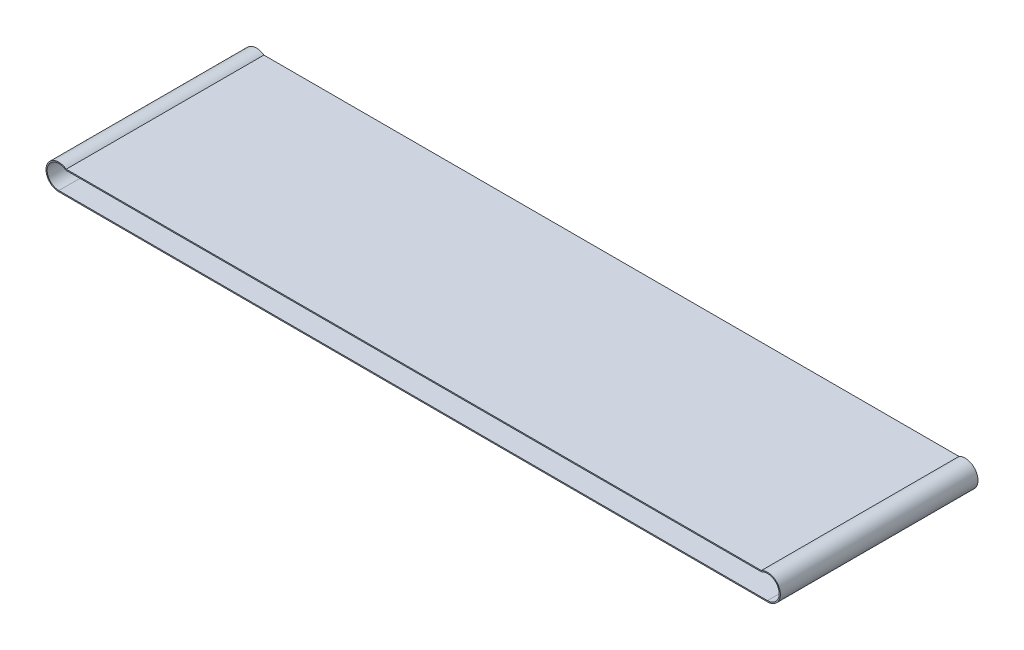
ISO-10303-21;
HEADER;
FILE_DESCRIPTION(('STEP AP214'),'2;1');
FILE_NAME('part.step','',(''),(''),'','','');
FILE_SCHEMA(('AUTOMOTIVE_DESIGN { 1 0 10303 214 1 1 1 1 }'));
ENDSEC;
DATA;
#1=APPLICATION_CONTEXT('core data for automotive mechanical design processes');
#2=APPLICATION_PROTOCOL_DEFINITION('international standard','automotive_design',2000,#1);
#3=PRODUCT_CONTEXT('',#1,'mechanical');
#4=PRODUCT('Part','Part','',(#3));
#5=PRODUCT_RELATED_PRODUCT_CATEGORY('part','',(#4));
#6=PRODUCT_DEFINITION_FORMATION('','',#4);
#7=PRODUCT_DEFINITION_CONTEXT('part definition',#1,'design');
#8=PRODUCT_DEFINITION('design','',#6,#7);
#9=PRODUCT_DEFINITION_SHAPE('','',#8);
#10=(LENGTH_UNIT() NAMED_UNIT(*) SI_UNIT(.MILLI.,.METRE.));
#11=(NAMED_UNIT(*) PLANE_ANGLE_UNIT() SI_UNIT($,.RADIAN.));
#12=(NAMED_UNIT(*) SI_UNIT($,.STERADIAN.) SOLID_ANGLE_UNIT());
#13=UNCERTAINTY_MEASURE_WITH_UNIT(LENGTH_MEASURE(1.E-05),#10,'distance_accuracy_value','');
#14=(GEOMETRIC_REPRESENTATION_CONTEXT(3) GLOBAL_UNCERTAINTY_ASSIGNED_CONTEXT((#13)) GLOBAL_UNIT_ASSIGNED_CONTEXT((#10,
#11,#12)) REPRESENTATION_CONTEXT('',''));
#15=CARTESIAN_POINT('',(0.,0.,0.));
#16=DIRECTION('',(0.,0.,1.));
#17=DIRECTION('',(1.,0.,0.));
#18=AXIS2_PLACEMENT_3D('',#15,#16,#17);
#19=CARTESIAN_POINT('',(38.0007942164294,44.6619074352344,175.));
#20=DIRECTION('',(0.,0.,1.));
#21=DIRECTION('',(1.,0.,0.));
#22=AXIS2_PLACEMENT_3D('',#19,#20,#21);
#23=PLANE('',#22);
#24=CARTESIAN_POINT('',(38.0007942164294,44.6619074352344,175.));
#25=DIRECTION('',(0.,0.,1.));
#26=DIRECTION('',(1.,0.,0.));
#27=AXIS2_PLACEMENT_3D('',#24,#25,#26);
#28=CIRCLE('',#27,22.7499999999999);
#29=CARTESIAN_POINT('',(51.117398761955,63.25,175.));
#30=VERTEX_POINT('',#29);
#31=CARTESIAN_POINT('',(37.97519987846,21.9119218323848,175.));
#32=VERTEX_POINT('',#31);
#33=EDGE_CURVE('E159',#30,#32,#28,.T.);
#34=ORIENTED_EDGE('',*,*,#33,.T.);
#35=DIRECTION('',(0.999999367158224,-0.00112502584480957,0.));
#36=VECTOR('',#35,1.);
#37=CARTESIAN_POINT('',(37.97519987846,21.9119218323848,175.));
#38=LINE('',#37,#36);
#39=CARTESIAN_POINT('',(1292.97440566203,20.5000143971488,175.));
#40=VERTEX_POINT('',#39);
#41=EDGE_CURVE('E162',#32,#40,#38,.T.);
#42=ORIENTED_EDGE('',*,*,#41,.T.);
#43=CARTESIAN_POINT('',(1293.,43.2499999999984,175.));
#44=DIRECTION('',(0.,0.,1.));
#45=DIRECTION('',(1.,0.,0.));
#46=AXIS2_PLACEMENT_3D('',#43,#44,#45);
#47=CIRCLE('',#46,22.75);
#48=CARTESIAN_POINT('',(1282.1573757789,63.2500000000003,175.));
#49=VERTEX_POINT('',#48);
#50=EDGE_CURVE('E165',#40,#49,#47,.T.);
#51=ORIENTED_EDGE('',*,*,#50,.T.);
#52=DIRECTION('',(-1.,0.,0.));
#53=VECTOR('',#52,1.);
#54=CARTESIAN_POINT('',(50.4666549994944,63.25,175.));
#55=LINE('',#54,#53);
#56=EDGE_CURVE('E167',#49,#30,#55,.T.);
#57=ORIENTED_EDGE('',*,*,#56,.T.);
#58=EDGE_LOOP('',(#34,#42,#51,#57));
#59=FACE_BOUND('',#58,.T.);
#60=DIRECTION('',(0.999999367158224,-0.00112502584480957,0.));
#61=VECTOR('',#60,1.);
#62=CARTESIAN_POINT('',(37.9774499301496,23.9119205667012,175.));
#63=LINE('',#62,#61);
#64=CARTESIAN_POINT('',(37.9774499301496,23.9119205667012,175.));
#65=VERTEX_POINT('',#64);
#66=CARTESIAN_POINT('',(1292.97665571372,22.5000131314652,175.));
#67=VERTEX_POINT('',#66);
#68=EDGE_CURVE('E131',#65,#67,#63,.T.);
#69=ORIENTED_EDGE('',*,*,#68,.F.);
#70=CARTESIAN_POINT('',(38.0007942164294,44.6619074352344,175.));
#71=DIRECTION('',(0.,0.,1.));
#72=DIRECTION('',(1.,0.,0.));
#73=AXIS2_PLACEMENT_3D('',#70,#71,#72);
#74=CIRCLE('',#73,20.7499999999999);
#75=CARTESIAN_POINT('',(50.4666549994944,61.25,175.));
#76=VERTEX_POINT('',#75);
#77=EDGE_CURVE('E123',#76,#65,#74,.T.);
#78=ORIENTED_EDGE('',*,*,#77,.F.);
#79=DIRECTION('',(-1.,0.,0.));
#80=VECTOR('',#79,1.);
#81=CARTESIAN_POINT('',(50.4666549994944,61.25,175.));
#82=LINE('',#81,#80);
#83=CARTESIAN_POINT('',(1282.67708858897,61.2500000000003,175.));
#84=VERTEX_POINT('',#83);
#85=EDGE_CURVE('E145',#84,#76,#82,.T.);
#86=ORIENTED_EDGE('',*,*,#85,.F.);
#87=CARTESIAN_POINT('',(1293.,43.2499999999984,175.));
#88=DIRECTION('',(0.,0.,1.));
#89=DIRECTION('',(1.,0.,0.));
#90=AXIS2_PLACEMENT_3D('',#87,#88,#89);
#91=CIRCLE('',#90,20.75);
#92=EDGE_CURVE('E143',#67,#84,#91,.T.);
#93=ORIENTED_EDGE('',*,*,#92,.F.);
#94=EDGE_LOOP('',(#69,#78,#86,#93));
#95=FACE_BOUND('',#94,.T.);
#96=ADVANCED_FACE('F58',(#59,#95),#23,.T.);
#97=CARTESIAN_POINT('',(38.0007942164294,44.6619074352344,-175.));
#98=DIRECTION('',(0.,0.,1.));
#99=DIRECTION('',(1.,0.,0.));
#100=AXIS2_PLACEMENT_3D('',#97,#98,#99);
#101=PLANE('',#100);
#102=CARTESIAN_POINT('',(38.0007942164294,44.6619074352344,-175.));
#103=DIRECTION('',(0.,0.,1.));
#104=DIRECTION('',(1.,0.,0.));
#105=AXIS2_PLACEMENT_3D('',#102,#103,#104);
#106=CIRCLE('',#105,22.7499999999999);
#107=CARTESIAN_POINT('',(51.117398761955,63.25,-175.));
#108=VERTEX_POINT('',#107);
#109=CARTESIAN_POINT('',(37.97519987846,21.9119218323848,-175.));
#110=VERTEX_POINT('',#109);
#111=EDGE_CURVE('E139',#108,#110,#106,.T.);
#112=ORIENTED_EDGE('',*,*,#111,.F.);
#113=DIRECTION('',(-1.,0.,0.));
#114=VECTOR('',#113,1.);
#115=CARTESIAN_POINT('',(50.4666549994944,63.25,-175.));
#116=LINE('',#115,#114);
#117=CARTESIAN_POINT('',(1282.1573757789,63.2500000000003,-175.));
#118=VERTEX_POINT('',#117);
#119=EDGE_CURVE('E163',#118,#108,#116,.T.);
#120=ORIENTED_EDGE('',*,*,#119,.F.);
#121=CARTESIAN_POINT('',(1293.,43.2499999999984,-175.));
#122=DIRECTION('',(0.,0.,1.));
#123=DIRECTION('',(1.,0.,0.));
#124=AXIS2_PLACEMENT_3D('',#121,#122,#123);
#125=CIRCLE('',#124,22.75);
#126=CARTESIAN_POINT('',(1292.97440566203,20.5000143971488,-175.));
#127=VERTEX_POINT('',#126);
#128=EDGE_CURVE('E174',#127,#118,#125,.T.);
#129=ORIENTED_EDGE('',*,*,#128,.F.);
#130=DIRECTION('',(0.999999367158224,-0.00112502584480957,0.));
#131=VECTOR('',#130,1.);
#132=CARTESIAN_POINT('',(37.97519987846,21.9119218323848,-175.));
#133=LINE('',#132,#131);
#134=EDGE_CURVE('E172',#110,#127,#133,.T.);
#135=ORIENTED_EDGE('',*,*,#134,.F.);
#136=EDGE_LOOP('',(#112,#120,#129,#135));
#137=FACE_BOUND('',#136,.T.);
#138=CARTESIAN_POINT('',(38.0007942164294,44.6619074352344,-175.));
#139=DIRECTION('',(0.,0.,1.));
#140=DIRECTION('',(1.,0.,0.));
#141=AXIS2_PLACEMENT_3D('',#138,#139,#140);
#142=CIRCLE('',#141,20.7499999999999);
#143=CARTESIAN_POINT('',(50.4666549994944,61.25,-175.));
#144=VERTEX_POINT('',#143);
#145=CARTESIAN_POINT('',(37.9774499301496,23.9119205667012,-175.));
#146=VERTEX_POINT('',#145);
#147=EDGE_CURVE('E81',#144,#146,#142,.T.);
#148=ORIENTED_EDGE('',*,*,#147,.T.);
#149=DIRECTION('',(0.999999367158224,-0.00112502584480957,0.));
#150=VECTOR('',#149,1.);
#151=CARTESIAN_POINT('',(37.9774499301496,23.9119205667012,-175.));
#152=LINE('',#151,#150);
#153=CARTESIAN_POINT('',(1292.97665571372,22.5000131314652,-175.));
#154=VERTEX_POINT('',#153);
#155=EDGE_CURVE('E138',#146,#154,#152,.T.);
#156=ORIENTED_EDGE('',*,*,#155,.T.);
#157=CARTESIAN_POINT('',(1293.,43.2499999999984,-175.));
#158=DIRECTION('',(0.,0.,1.));
#159=DIRECTION('',(1.,0.,0.));
#160=AXIS2_PLACEMENT_3D('',#157,#158,#159);
#161=CIRCLE('',#160,20.75);
#162=CARTESIAN_POINT('',(1282.67708858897,61.2500000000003,-175.));
#163=VERTEX_POINT('',#162);
#164=EDGE_CURVE('E151',#154,#163,#161,.T.);
#165=ORIENTED_EDGE('',*,*,#164,.T.);
#166=DIRECTION('',(-1.,0.,0.));
#167=VECTOR('',#166,1.);
#168=CARTESIAN_POINT('',(50.4666549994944,61.25,-175.));
#169=LINE('',#168,#167);
#170=EDGE_CURVE('E132',#163,#144,#169,.T.);
#171=ORIENTED_EDGE('',*,*,#170,.T.);
#172=EDGE_LOOP('',(#148,#156,#165,#171));
#173=FACE_BOUND('',#172,.T.);
#174=ADVANCED_FACE('F192',(#137,#173),#101,.F.);
#175=CARTESIAN_POINT('',(38.0007942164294,44.6619074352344,175.));
#176=DIRECTION('',(0.,0.,-1.));
#177=DIRECTION('',(-1.,0.,0.));
#178=AXIS2_PLACEMENT_3D('',#175,#176,#177);
#179=CYLINDRICAL_SURFACE('',#178,22.7499999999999);
#180=ORIENTED_EDGE('',*,*,#111,.T.);
#181=DIRECTION('',(0.,0.,-1.));
#182=VECTOR('',#181,1.);
#183=CARTESIAN_POINT('',(37.97519987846,21.9119218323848,175.));
#184=LINE('',#183,#182);
#185=EDGE_CURVE('E12',#32,#110,#184,.T.);
#186=ORIENTED_EDGE('',*,*,#185,.F.);
#187=ORIENTED_EDGE('',*,*,#33,.F.);
#188=DIRECTION('',(0.,0.,-1.));
#189=VECTOR('',#188,1.);
#190=CARTESIAN_POINT('',(51.117398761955,63.25,175.));
#191=LINE('',#190,#189);
#192=EDGE_CURVE('E169',#30,#108,#191,.T.);
#193=ORIENTED_EDGE('',*,*,#192,.T.);
#194=EDGE_LOOP('',(#180,#186,#187,#193));
#195=FACE_BOUND('',#194,.T.);
#196=ADVANCED_FACE('F60',(#195),#179,.T.);
#197=CARTESIAN_POINT('',(37.97519987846,21.9119218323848,175.));
#198=DIRECTION('',(0.00112502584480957,0.999999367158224,0.));
#199=DIRECTION('',(-0.999999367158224,0.00112502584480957,0.));
#200=AXIS2_PLACEMENT_3D('',#197,#198,#199);
#201=PLANE('',#200);
#202=ORIENTED_EDGE('',*,*,#134,.T.);
#203=DIRECTION('',(0.,0.,-1.));
#204=VECTOR('',#203,1.);
#205=CARTESIAN_POINT('',(1292.97440566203,20.5000143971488,175.));
#206=LINE('',#205,#204);
#207=EDGE_CURVE('E66',#40,#127,#206,.T.);
#208=ORIENTED_EDGE('',*,*,#207,.F.);
#209=ORIENTED_EDGE('',*,*,#41,.F.);
#210=ORIENTED_EDGE('',*,*,#185,.T.);
#211=EDGE_LOOP('',(#202,#208,#209,#210));
#212=FACE_BOUND('',#211,.T.);
#213=ADVANCED_FACE('F202',(#212),#201,.F.);
#214=CARTESIAN_POINT('',(1293.,43.2499999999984,175.));
#215=DIRECTION('',(0.,0.,-1.));
#216=DIRECTION('',(-1.,0.,0.));
#217=AXIS2_PLACEMENT_3D('',#214,#215,#216);
#218=CYLINDRICAL_SURFACE('',#217,22.75);
#219=ORIENTED_EDGE('',*,*,#128,.T.);
#220=DIRECTION('',(0.,0.,-1.));
#221=VECTOR('',#220,1.);
#222=CARTESIAN_POINT('',(1282.1573757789,63.2500000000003,175.));
#223=LINE('',#222,#221);
#224=EDGE_CURVE('E179',#49,#118,#223,.T.);
#225=ORIENTED_EDGE('',*,*,#224,.F.);
#226=ORIENTED_EDGE('',*,*,#50,.F.);
#227=ORIENTED_EDGE('',*,*,#207,.T.);
#228=EDGE_LOOP('',(#219,#225,#226,#227));
#229=FACE_BOUND('',#228,.T.);
#230=ADVANCED_FACE('F186',(#229),#218,.T.);
#231=CARTESIAN_POINT('',(50.4666549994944,63.25,175.));
#232=DIRECTION('',(0.,-1.,0.));
#233=DIRECTION('',(1.,0.,0.));
#234=AXIS2_PLACEMENT_3D('',#231,#232,#233);
#235=PLANE('',#234);
#236=ORIENTED_EDGE('',*,*,#119,.T.);
#237=ORIENTED_EDGE('',*,*,#192,.F.);
#238=ORIENTED_EDGE('',*,*,#56,.F.);
#239=ORIENTED_EDGE('',*,*,#224,.T.);
#240=EDGE_LOOP('',(#236,#237,#238,#239));
#241=FACE_BOUND('',#240,.T.);
#242=ADVANCED_FACE('F196',(#241),#235,.F.);
#243=CARTESIAN_POINT('',(38.0007942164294,44.6619074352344,175.));
#244=DIRECTION('',(0.,0.,-1.));
#245=DIRECTION('',(-1.,0.,0.));
#246=AXIS2_PLACEMENT_3D('',#243,#244,#245);
#247=CYLINDRICAL_SURFACE('',#246,20.7499999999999);
#248=ORIENTED_EDGE('',*,*,#147,.F.);
#249=DIRECTION('',(0.,0.,-1.));
#250=VECTOR('',#249,1.);
#251=CARTESIAN_POINT('',(50.4666549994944,61.25,175.));
#252=LINE('',#251,#250);
#253=EDGE_CURVE('E127',#76,#144,#252,.T.);
#254=ORIENTED_EDGE('',*,*,#253,.F.);
#255=ORIENTED_EDGE('',*,*,#77,.T.);
#256=DIRECTION('',(0.,0.,-1.));
#257=VECTOR('',#256,1.);
#258=CARTESIAN_POINT('',(37.9774499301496,23.9119205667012,175.));
#259=LINE('',#258,#257);
#260=EDGE_CURVE('E126',#65,#146,#259,.T.);
#261=ORIENTED_EDGE('',*,*,#260,.T.);
#262=EDGE_LOOP('',(#248,#254,#255,#261));
#263=FACE_BOUND('',#262,.T.);
#264=ADVANCED_FACE('F125',(#263),#247,.F.);
#265=CARTESIAN_POINT('',(37.9774499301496,23.9119205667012,175.));
#266=DIRECTION('',(0.00112502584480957,0.999999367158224,0.));
#267=DIRECTION('',(-0.999999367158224,0.00112502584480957,0.));
#268=AXIS2_PLACEMENT_3D('',#265,#266,#267);
#269=PLANE('',#268);
#270=ORIENTED_EDGE('',*,*,#155,.F.);
#271=ORIENTED_EDGE('',*,*,#260,.F.);
#272=ORIENTED_EDGE('',*,*,#68,.T.);
#273=DIRECTION('',(0.,0.,-1.));
#274=VECTOR('',#273,1.);
#275=CARTESIAN_POINT('',(1292.97665571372,22.5000131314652,175.));
#276=LINE('',#275,#274);
#277=EDGE_CURVE('E140',#67,#154,#276,.T.);
#278=ORIENTED_EDGE('',*,*,#277,.T.);
#279=EDGE_LOOP('',(#270,#271,#272,#278));
#280=FACE_BOUND('',#279,.T.);
#281=ADVANCED_FACE('F135',(#280),#269,.T.);
#282=CARTESIAN_POINT('',(1293.,43.2499999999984,175.));
#283=DIRECTION('',(0.,0.,-1.));
#284=DIRECTION('',(-1.,0.,0.));
#285=AXIS2_PLACEMENT_3D('',#282,#283,#284);
#286=CYLINDRICAL_SURFACE('',#285,20.75);
#287=ORIENTED_EDGE('',*,*,#164,.F.);
#288=ORIENTED_EDGE('',*,*,#277,.F.);
#289=ORIENTED_EDGE('',*,*,#92,.T.);
#290=DIRECTION('',(0.,0.,-1.));
#291=VECTOR('',#290,1.);
#292=CARTESIAN_POINT('',(1282.67708858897,61.2500000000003,175.));
#293=LINE('',#292,#291);
#294=EDGE_CURVE('E73',#84,#163,#293,.T.);
#295=ORIENTED_EDGE('',*,*,#294,.T.);
#296=EDGE_LOOP('',(#287,#288,#289,#295));
#297=FACE_BOUND('',#296,.T.);
#298=ADVANCED_FACE('F225',(#297),#286,.F.);
#299=CARTESIAN_POINT('',(50.4666549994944,61.25,175.));
#300=DIRECTION('',(0.,-1.,0.));
#301=DIRECTION('',(1.,0.,0.));
#302=AXIS2_PLACEMENT_3D('',#299,#300,#301);
#303=PLANE('',#302);
#304=ORIENTED_EDGE('',*,*,#170,.F.);
#305=ORIENTED_EDGE('',*,*,#294,.F.);
#306=ORIENTED_EDGE('',*,*,#85,.T.);
#307=ORIENTED_EDGE('',*,*,#253,.T.);
#308=EDGE_LOOP('',(#304,#305,#306,#307));
#309=FACE_BOUND('',#308,.T.);
#310=ADVANCED_FACE('F229',(#309),#303,.T.);
#311=CLOSED_SHELL('',(#96,#174,#196,#213,#230,#242,#264,#281,#298,#310));
#312=MANIFOLD_SOLID_BREP('B2',#311);
#313=ADVANCED_BREP_SHAPE_REPRESENTATION('',(#18,#312),#14);
#314=SHAPE_DEFINITION_REPRESENTATION(#9,#313);
ENDSEC;
END-ISO-10303-21;
